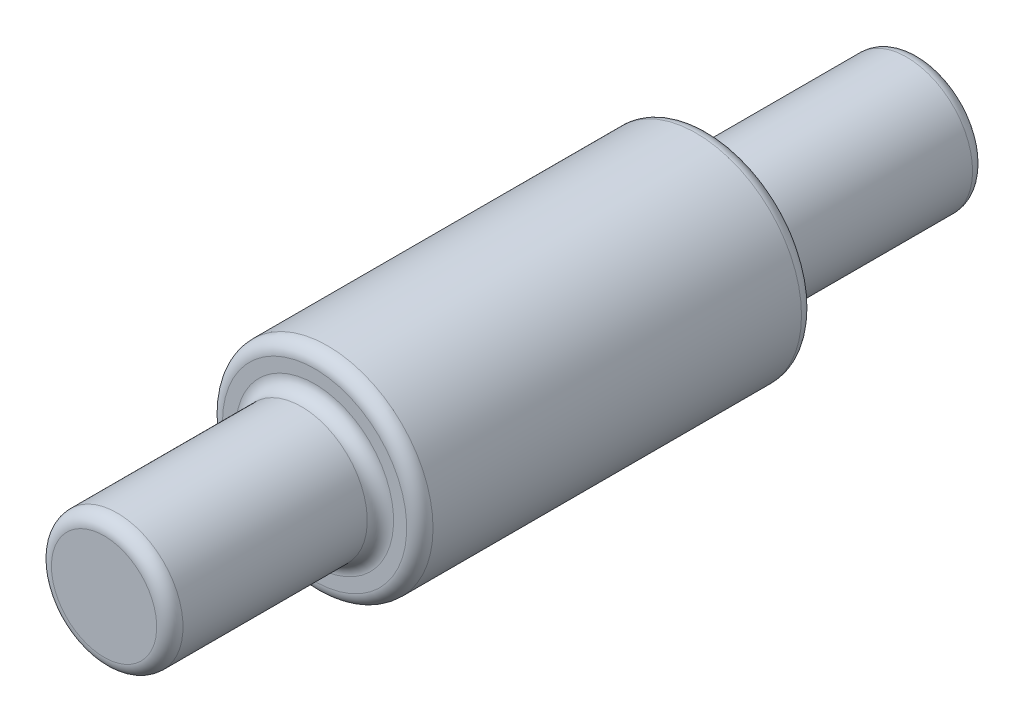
from build123d import *

# Parameters (mm, degrees)
FILLET_1_R = 0.5


with BuildPart() as part:
    # Sketch 1 → Revolve 1 (revolve)
    with BuildSketch(Plane(origin=(0, 0, 0), x_dir=(0, 0, -1), z_dir=(1, 0, 0)), mode=Mode.PRIVATE) as revolve_1_sk:
        Polygon((-15.5, 0), (15.5, 0), (15.5, 2.5), (7.5, 2.5), (7.5, 4), (-7.5, 4), (-7.5, 2.5), (-15.5, 2.5), align=None)
    revolve(revolve_1_sk.sketch.rotate(Axis((0, 0, 15.5), (0, 0, -1)), 90), axis=Axis((0, 0, 15.5), (0, 0, -1)))

    # Fillet 1
    fillet_1_edges = [part.edges().sort_by_distance(p)[0] for p in [
        (-2.5, 0, 15.5),
        (-2.5, 0, 7.5),
        (-4, 0, 7.5),
        (-4, 0, -7.5),
        (-2.5, 0, -7.5),
        (-2.5, 0, -15.5),
    ]]
    fillet(fillet_1_edges, radius=FILLET_1_R)


solid = part.part
